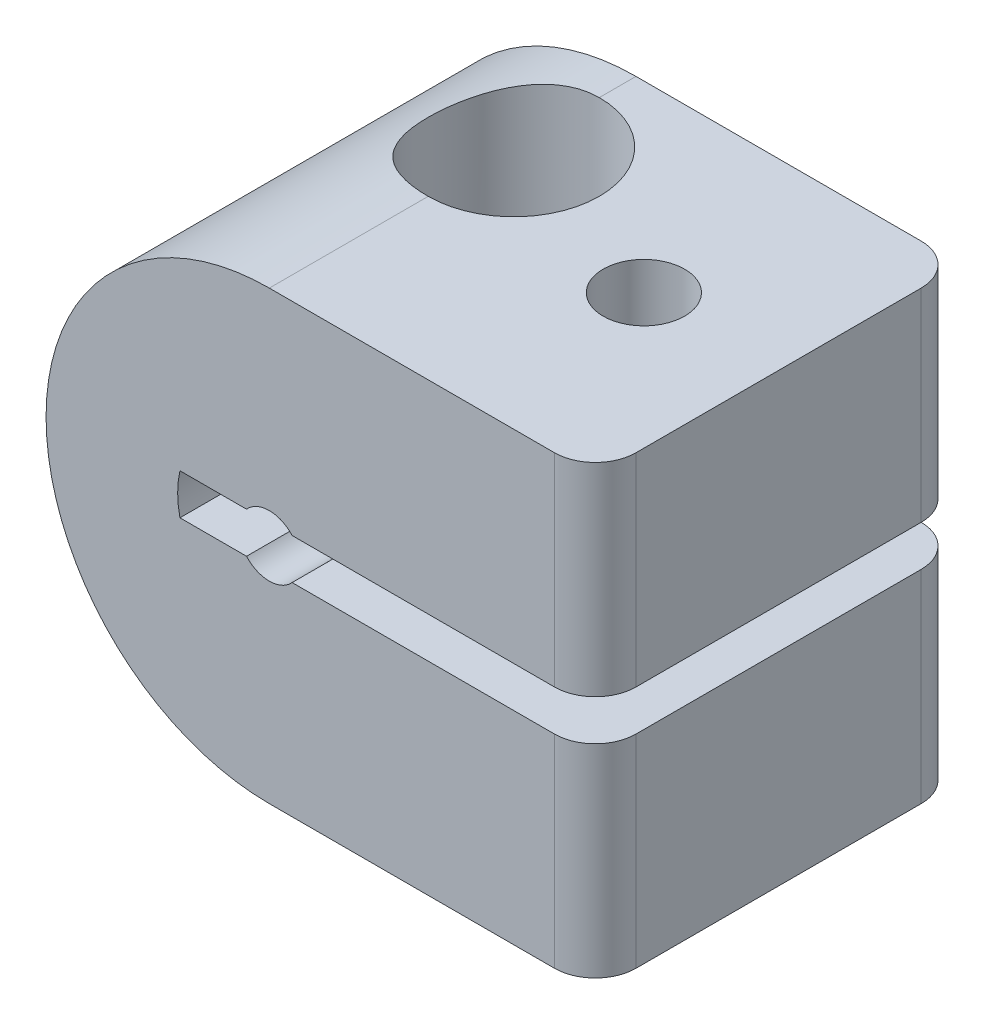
from build123d import *

# Parameters (mm, degrees)
BOSS_EXTRUDE1_DEPTH     = 5.08
SKETCH6_R               = 0.9525
CUT_EXTRUDE4_DEPTH      = 8.89
BOSS_EXTRUDE2_START     = 6.35
BOSS_EXTRUDE2_DEPTH     = 6.35
SKETCH7_R               = 2.8575
CUT_EXTRUDE5_DEPTH      = 7.62
FILLET1_R               = 1.27
CUT_EXTRUDE2_DEPTH      = 17.801980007
SKETCH5_R               = 1.27
CUT_EXTRUDE3_DEPTH      = 19.36551738
CUT_EXTRUDE6_REACH      = 20.366
CUT_EXTRUDE6_END_RADIUS = 2.8575
SKETCH8_R               = 2.667


with BuildPart() as part:
    # Sketch1 → Boss-Extrude1 (new body)
    with BuildSketch(Plane.XY):
        with BuildLine():
            Line((0, 6.9596), (10.16, 6.9596))
            Line((10.16, 6.9596), (10.16, -6.9596))
            Line((10.16, -6.9596), (0, -6.9596))
            ThreePointArc((0, -6.9596), (-6.9596, 0), (0, 6.9596))
        make_face()
    extrude(amount=BOSS_EXTRUDE1_DEPTH)

    # Sketch6 → Cut-Extrude4 (cut)
    with BuildSketch(Plane.XY.offset(5.08)):
        Circle(SKETCH6_R)
    extrude(amount=-CUT_EXTRUDE4_DEPTH, mode=Mode.SUBTRACT)

    # Sketch2 → Boss-Extrude2 (add)
    with BuildSketch(Plane(origin=(0, 0, 0), x_dir=(-1, 0, 0), z_dir=(0, 0, -1)).offset(BOSS_EXTRUDE2_START)):
        with BuildLine():
            Line((-10.16, 6.9596), (0, 6.9596))
            ThreePointArc((0, 6.9596), (6.9596, 0), (0, -6.9596))
            Line((0, -6.9596), (-10.16, -6.9596))
            Line((-10.16, -6.9596), (-10.16, 6.9596))
        make_face()
    extrude(amount=-BOSS_EXTRUDE2_DEPTH)

    # Sketch7 → Cut-Extrude5 (cut)
    with BuildSketch(Plane.XY.offset(-6.35)):
        with Locations(Location((0, 0, 0), (0, 0, 180))):
            Circle(SKETCH7_R)
    extrude(amount=CUT_EXTRUDE5_DEPTH, mode=Mode.SUBTRACT)

    # Fillet1
    fillet1_edges = [part.edges().sort_by_distance(p)[0] for p in [
        (10.16, 0, 5.08),
        (10.16, 0, -6.35),
    ]]
    fillet(fillet1_edges, radius=FILLET1_R)

    # Sketch4 → Cut-Extrude2 (cut, through all)
    with BuildSketch(Plane.XY.offset(-6.35)):
        with BuildLine():
            Line((10.16, 0.635), (-2.786051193, 0.635))
            ThreePointArc((-2.786051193, 0.635), (-2.8575, 0), (-2.786051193, -0.635))
            Line((-2.786051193, -0.635), (10.16, -0.635))
            Line((10.16, -0.635), (10.16, 0.635))
        make_face()
    extrude(amount=CUT_EXTRUDE2_DEPTH, mode=Mode.SUBTRACT)

    # Sketch5 → Cut-Extrude3 (cut, through all)
    with BuildSketch(Plane(origin=(0, 6.9596, 0), x_dir=(1, 0, 0), z_dir=(0, 1, 0))):
        with Locations(Location((5.961051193, 0.635, 0), (0, 0, 270))):
            Circle(SKETCH5_R)
    extrude(amount=-CUT_EXTRUDE3_DEPTH, mode=Mode.SUBTRACT)

    # Cut-Extrude6: up to this cylinder (the profile starts outside it)
    cut_extrude6_end = Plane(origin=(0, 0, -2.54), z_dir=(0, 0, -1)) * Cylinder(CUT_EXTRUDE6_END_RADIUS, 47.447, mode=Mode.PRIVATE)
    # Sketch8 → Cut-Extrude6 (cut, up to the surface)
    with BuildSketch(Plane(origin=(0, 6.9596, 0), x_dir=(1, 0, 0), z_dir=(0, 1, 0)), mode=Mode.PRIVATE) as cut_extrude6_sk1:
        with Locations(Location((0, 2.54, 0), (0, 0, 270))):
            Circle(SKETCH8_R)
    cut_extrude6_tool1 = extrude(cut_extrude6_sk1.sketch, amount=-CUT_EXTRUDE6_REACH, mode=Mode.PRIVATE) - cut_extrude6_end
    add(cut_extrude6_tool1.solids().sort_by_distance((0, 6.9596, -2.54))[0], mode=Mode.SUBTRACT)


solid = part.part
